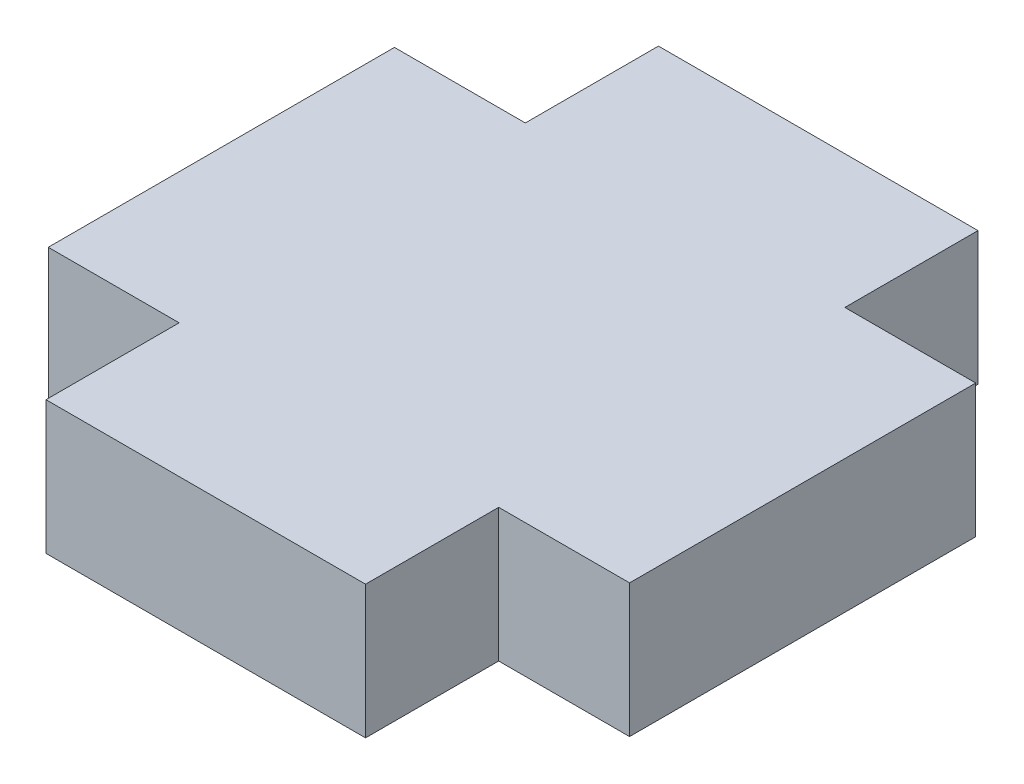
from build123d import *

# Parameters (mm, degrees)
BOSS_EXTRUDE1_DEPTH = 5


with BuildPart() as part:
    # Sketch1 → Boss-Extrude1 (new body)
    with BuildSketch(Plane(origin=(0, 0, 0), x_dir=(1, 0, 0), z_dir=(0, 1, 0))):
        Polygon((-6, -6.5), (-6, -11.5), (6, -11.5), (6, -6.5), (10.915, -6.5), (10.915, 6.5), (6, 6.5), (6, 11.5), (-6, 11.5), (-6, 6.5), (-10.915, 6.5), (-10.915, -6.5), align=None)
    extrude(amount=BOSS_EXTRUDE1_DEPTH)


solid = part.part
